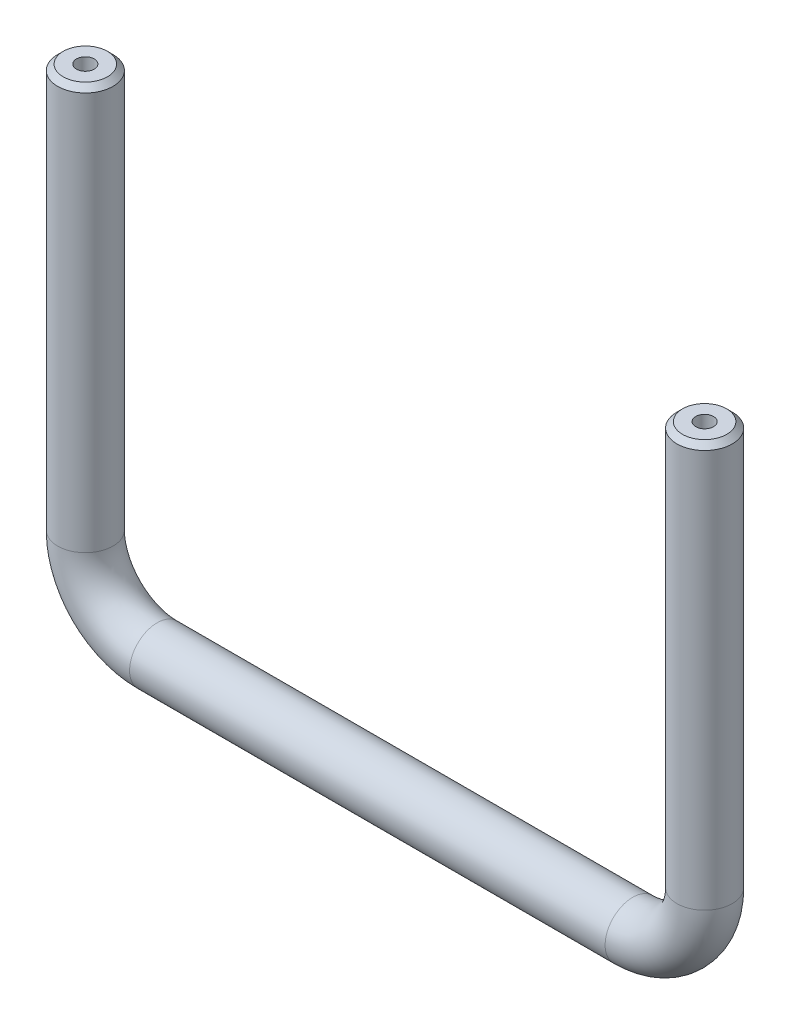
ISO-10303-21;
HEADER;
FILE_DESCRIPTION(('STEP AP214'),'2;1');
FILE_NAME('part.step','',(''),(''),'','','');
FILE_SCHEMA(('AUTOMOTIVE_DESIGN { 1 0 10303 214 1 1 1 1 }'));
ENDSEC;
DATA;
#1=APPLICATION_CONTEXT('core data for automotive mechanical design processes');
#2=APPLICATION_PROTOCOL_DEFINITION('international standard','automotive_design',2000,#1);
#3=PRODUCT_CONTEXT('',#1,'mechanical');
#4=PRODUCT('Part','Part','',(#3));
#5=PRODUCT_RELATED_PRODUCT_CATEGORY('part','',(#4));
#6=PRODUCT_DEFINITION_FORMATION('','',#4);
#7=PRODUCT_DEFINITION_CONTEXT('part definition',#1,'design');
#8=PRODUCT_DEFINITION('design','',#6,#7);
#9=PRODUCT_DEFINITION_SHAPE('','',#8);
#10=(LENGTH_UNIT() NAMED_UNIT(*) SI_UNIT(.MILLI.,.METRE.));
#11=(NAMED_UNIT(*) PLANE_ANGLE_UNIT() SI_UNIT($,.RADIAN.));
#12=(NAMED_UNIT(*) SI_UNIT($,.STERADIAN.) SOLID_ANGLE_UNIT());
#13=UNCERTAINTY_MEASURE_WITH_UNIT(LENGTH_MEASURE(1.E-05),#10,'distance_accuracy_value','');
#14=(GEOMETRIC_REPRESENTATION_CONTEXT(3) GLOBAL_UNCERTAINTY_ASSIGNED_CONTEXT((#13)) GLOBAL_UNIT_ASSIGNED_CONTEXT((#10,
#11,#12)) REPRESENTATION_CONTEXT('',''));
#15=CARTESIAN_POINT('',(0.,0.,0.));
#16=DIRECTION('',(0.,0.,1.));
#17=DIRECTION('',(1.,0.,0.));
#18=AXIS2_PLACEMENT_3D('',#15,#16,#17);
#19=CARTESIAN_POINT('',(88.9,20.6375,0.));
#20=DIRECTION('',(0.,1.,0.));
#21=DIRECTION('',(-1.,0.,0.));
#22=AXIS2_PLACEMENT_3D('',#19,#20,#21);
#23=CYLINDRICAL_SURFACE('',#22,7.93749999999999);
#24=CARTESIAN_POINT('',(88.8999999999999,134.9375,0.));
#25=DIRECTION('',(0.,1.,0.));
#26=DIRECTION('',(0.,0.,1.));
#27=AXIS2_PLACEMENT_3D('',#24,#25,#26);
#28=CIRCLE('',#27,7.93749999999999);
#29=CARTESIAN_POINT('',(88.8999999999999,134.9375,7.93749999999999));
#30=VERTEX_POINT('',#29);
#31=EDGE_CURVE('E108',#30,#30,#28,.F.);
#32=ORIENTED_EDGE('',*,*,#31,.T.);
#33=EDGE_LOOP('',(#32));
#34=FACE_BOUND('',#33,.T.);
#35=CARTESIAN_POINT('',(88.9,20.6375,0.));
#36=DIRECTION('',(0.,1.,0.));
#37=DIRECTION('',(-1.,0.,0.));
#38=AXIS2_PLACEMENT_3D('',#35,#36,#37);
#39=CIRCLE('',#38,7.93749999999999);
#40=CARTESIAN_POINT('',(96.8375,20.6375,0.));
#41=VERTEX_POINT('',#40);
#42=EDGE_CURVE('E100',#41,#41,#39,.T.);
#43=ORIENTED_EDGE('',*,*,#42,.T.);
#44=EDGE_LOOP('',(#43));
#45=FACE_BOUND('',#44,.T.);
#46=ADVANCED_FACE('F46',(#34,#45),#23,.T.);
#47=CARTESIAN_POINT('',(68.2625,20.6375,0.));
#48=DIRECTION('',(0.,0.,1.));
#49=DIRECTION('',(1.,0.,0.));
#50=AXIS2_PLACEMENT_3D('',#47,#48,#49);
#51=TOROIDAL_SURFACE('',#50,20.6375,7.93749999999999);
#52=CARTESIAN_POINT('',(68.2625,0.,0.));
#53=DIRECTION('',(1.,0.,0.));
#54=DIRECTION('',(0.,1.,0.));
#55=AXIS2_PLACEMENT_3D('',#52,#53,#54);
#56=CIRCLE('',#55,7.93749999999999);
#57=CARTESIAN_POINT('',(68.2625,-7.93749999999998,0.));
#58=VERTEX_POINT('',#57);
#59=EDGE_CURVE('E96',#58,#58,#56,.T.);
#60=CARTESIAN_POINT('',(68.2625,20.6375,0.));
#61=DIRECTION('',(0.,0.,1.));
#62=DIRECTION('',(1.,0.,0.));
#63=AXIS2_PLACEMENT_3D('',#60,#61,#62);
#64=CIRCLE('',#63,28.575);
#65=EDGE_CURVE('',#58,#41,#64,.T.);
#66=ORIENTED_EDGE('',*,*,#59,.T.);
#67=ORIENTED_EDGE('',*,*,#42,.F.);
#68=ORIENTED_EDGE('',*,*,#65,.T.);
#69=ORIENTED_EDGE('',*,*,#65,.F.);
#70=EDGE_LOOP('',(#66,#68,#67,#69));
#71=FACE_BOUND('',#70,.T.);
#72=ADVANCED_FACE('F131',(#71),#51,.T.);
#73=CARTESIAN_POINT('',(-68.2625,0.,0.));
#74=DIRECTION('',(1.,0.,0.));
#75=DIRECTION('',(0.,1.,0.));
#76=AXIS2_PLACEMENT_3D('',#73,#74,#75);
#77=CYLINDRICAL_SURFACE('',#76,7.93749999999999);
#78=CARTESIAN_POINT('',(-68.2625,0.,0.));
#79=DIRECTION('',(1.,0.,0.));
#80=DIRECTION('',(0.,1.,0.));
#81=AXIS2_PLACEMENT_3D('',#78,#79,#80);
#82=CIRCLE('',#81,7.93749999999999);
#83=CARTESIAN_POINT('',(-68.2625,-7.93750000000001,0.));
#84=VERTEX_POINT('',#83);
#85=EDGE_CURVE('E92',#84,#84,#82,.T.);
#86=ORIENTED_EDGE('',*,*,#85,.T.);
#87=EDGE_LOOP('',(#86));
#88=FACE_BOUND('',#87,.T.);
#89=ORIENTED_EDGE('',*,*,#59,.F.);
#90=EDGE_LOOP('',(#89));
#91=FACE_BOUND('',#90,.T.);
#92=ADVANCED_FACE('F137',(#88,#91),#77,.T.);
#93=CARTESIAN_POINT('',(-68.2625,20.6375,0.));
#94=DIRECTION('',(0.,0.,1.));
#95=DIRECTION('',(1.,0.,0.));
#96=AXIS2_PLACEMENT_3D('',#93,#94,#95);
#97=TOROIDAL_SURFACE('',#96,20.6375,7.93749999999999);
#98=CARTESIAN_POINT('',(-88.9,20.6375,0.));
#99=DIRECTION('',(0.,-1.,0.));
#100=DIRECTION('',(1.,0.,0.));
#101=AXIS2_PLACEMENT_3D('',#98,#99,#100);
#102=CIRCLE('',#101,7.93749999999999);
#103=CARTESIAN_POINT('',(-96.8375,20.6375,0.));
#104=VERTEX_POINT('',#103);
#105=EDGE_CURVE('E88',#104,#104,#102,.T.);
#106=CARTESIAN_POINT('',(-68.2625,20.6375,0.));
#107=DIRECTION('',(0.,0.,1.));
#108=DIRECTION('',(1.,0.,0.));
#109=AXIS2_PLACEMENT_3D('',#106,#107,#108);
#110=CIRCLE('',#109,28.575);
#111=EDGE_CURVE('',#104,#84,#110,.T.);
#112=ORIENTED_EDGE('',*,*,#105,.T.);
#113=ORIENTED_EDGE('',*,*,#85,.F.);
#114=ORIENTED_EDGE('',*,*,#111,.T.);
#115=ORIENTED_EDGE('',*,*,#111,.F.);
#116=EDGE_LOOP('',(#112,#114,#113,#115));
#117=FACE_BOUND('',#116,.T.);
#118=ADVANCED_FACE('F144',(#117),#97,.T.);
#119=CARTESIAN_POINT('',(-88.9,20.6375,0.));
#120=DIRECTION('',(0.,1.,0.));
#121=DIRECTION('',(0.,0.,1.));
#122=AXIS2_PLACEMENT_3D('',#119,#120,#121);
#123=CYLINDRICAL_SURFACE('',#122,7.93749999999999);
#124=CARTESIAN_POINT('',(-88.9,134.9375,0.));
#125=DIRECTION('',(0.,-1.,0.));
#126=DIRECTION('',(0.,0.,-1.));
#127=AXIS2_PLACEMENT_3D('',#124,#125,#126);
#128=CIRCLE('',#127,7.93749999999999);
#129=CARTESIAN_POINT('',(-88.9,134.9375,-7.93749999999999));
#130=VERTEX_POINT('',#129);
#131=EDGE_CURVE('E55',#130,#130,#128,.T.);
#132=ORIENTED_EDGE('',*,*,#131,.T.);
#133=EDGE_LOOP('',(#132));
#134=FACE_BOUND('',#133,.T.);
#135=ORIENTED_EDGE('',*,*,#105,.F.);
#136=EDGE_LOOP('',(#135));
#137=FACE_BOUND('',#136,.T.);
#138=ADVANCED_FACE('F115',(#134,#137),#123,.T.);
#139=CARTESIAN_POINT('',(88.8999999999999,136.525,0.));
#140=DIRECTION('',(0.,1.,0.));
#141=DIRECTION('',(-1.,0.,0.));
#142=AXIS2_PLACEMENT_3D('',#139,#140,#141);
#143=PLANE('',#142);
#144=CARTESIAN_POINT('',(88.8999999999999,136.525,0.));
#145=DIRECTION('',(0.,1.,0.));
#146=DIRECTION('',(0.,0.,1.));
#147=AXIS2_PLACEMENT_3D('',#144,#145,#146);
#148=CIRCLE('',#147,2.55269999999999);
#149=CARTESIAN_POINT('',(88.8999999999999,136.525,2.55269999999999));
#150=VERTEX_POINT('',#149);
#151=EDGE_CURVE('E74',#150,#150,#148,.T.);
#152=ORIENTED_EDGE('',*,*,#151,.F.);
#153=EDGE_LOOP('',(#152));
#154=FACE_BOUND('',#153,.T.);
#155=CARTESIAN_POINT('',(88.8999999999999,136.525,0.));
#156=DIRECTION('',(0.,1.,0.));
#157=DIRECTION('',(-1.,0.,0.));
#158=AXIS2_PLACEMENT_3D('',#155,#156,#157);
#159=CIRCLE('',#158,6.34999999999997);
#160=CARTESIAN_POINT('',(82.55,136.525,0.));
#161=VERTEX_POINT('',#160);
#162=EDGE_CURVE('E104',#161,#161,#159,.T.);
#163=ORIENTED_EDGE('',*,*,#162,.T.);
#164=EDGE_LOOP('',(#163));
#165=FACE_BOUND('',#164,.T.);
#166=ADVANCED_FACE('F151',(#154,#165),#143,.T.);
#167=CARTESIAN_POINT('',(-88.9,136.525,0.));
#168=DIRECTION('',(0.,-1.,0.));
#169=DIRECTION('',(1.,0.,0.));
#170=AXIS2_PLACEMENT_3D('',#167,#168,#169);
#171=PLANE('',#170);
#172=CARTESIAN_POINT('',(-88.9,136.525,0.));
#173=DIRECTION('',(0.,1.,0.));
#174=DIRECTION('',(0.,0.,1.));
#175=AXIS2_PLACEMENT_3D('',#172,#173,#174);
#176=CIRCLE('',#175,2.55269999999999);
#177=CARTESIAN_POINT('',(-88.9,136.525,2.55269999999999));
#178=VERTEX_POINT('',#177);
#179=EDGE_CURVE('E75',#178,#178,#176,.T.);
#180=ORIENTED_EDGE('',*,*,#179,.F.);
#181=EDGE_LOOP('',(#180));
#182=FACE_BOUND('',#181,.T.);
#183=CARTESIAN_POINT('',(-88.9,136.525,0.));
#184=DIRECTION('',(0.,-1.,0.));
#185=DIRECTION('',(1.,0.,0.));
#186=AXIS2_PLACEMENT_3D('',#183,#184,#185);
#187=CIRCLE('',#186,6.35000000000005);
#188=CARTESIAN_POINT('',(-82.55,136.525,0.));
#189=VERTEX_POINT('',#188);
#190=EDGE_CURVE('E11',#189,#189,#187,.F.);
#191=ORIENTED_EDGE('',*,*,#190,.T.);
#192=EDGE_LOOP('',(#191));
#193=FACE_BOUND('',#192,.T.);
#194=ADVANCED_FACE('F127',(#182,#193),#171,.F.);
#195=CARTESIAN_POINT('',(88.8999999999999,136.525,0.));
#196=DIRECTION('',(0.,-1.,0.));
#197=DIRECTION('',(0.,0.,-1.));
#198=AXIS2_PLACEMENT_3D('',#195,#196,#197);
#199=CONICAL_SURFACE('',#198,6.34999999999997,0.78539816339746);
#200=ORIENTED_EDGE('',*,*,#31,.F.);
#201=EDGE_LOOP('',(#200));
#202=FACE_BOUND('',#201,.T.);
#203=ORIENTED_EDGE('',*,*,#162,.F.);
#204=EDGE_LOOP('',(#203));
#205=FACE_BOUND('',#204,.T.);
#206=ADVANCED_FACE('F120',(#202,#205),#199,.T.);
#207=CARTESIAN_POINT('',(-88.9,134.9375,0.));
#208=DIRECTION('',(0.,-1.,0.));
#209=DIRECTION('',(0.,0.,-1.));
#210=AXIS2_PLACEMENT_3D('',#207,#208,#209);
#211=CONICAL_SURFACE('',#210,7.93749999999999,0.785398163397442);
#212=ORIENTED_EDGE('',*,*,#190,.F.);
#213=EDGE_LOOP('',(#212));
#214=FACE_BOUND('',#213,.T.);
#215=ORIENTED_EDGE('',*,*,#131,.F.);
#216=EDGE_LOOP('',(#215));
#217=FACE_BOUND('',#216,.T.);
#218=ADVANCED_FACE('F48',(#214,#217),#211,.T.);
#219=CARTESIAN_POINT('',(88.8999999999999,111.125,0.));
#220=DIRECTION('',(0.,1.,0.));
#221=DIRECTION('',(0.,0.,1.));
#222=AXIS2_PLACEMENT_3D('',#219,#220,#221);
#223=CONICAL_SURFACE('',#222,2.55269999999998,1.02974425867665);
#224=CARTESIAN_POINT('',(88.8999999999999,109.591183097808,0.));
#225=VERTEX_POINT('',#224);
#226=VERTEX_LOOP('',#225);
#227=FACE_BOUND('',#226,.T.);
#228=CARTESIAN_POINT('',(88.8999999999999,111.125,0.));
#229=DIRECTION('',(0.,1.,0.));
#230=DIRECTION('',(0.,0.,1.));
#231=AXIS2_PLACEMENT_3D('',#228,#229,#230);
#232=CIRCLE('',#231,2.55269999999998);
#233=CARTESIAN_POINT('',(88.8999999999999,111.125,2.55269999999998));
#234=VERTEX_POINT('',#233);
#235=EDGE_CURVE('E80',#234,#234,#232,.T.);
#236=ORIENTED_EDGE('',*,*,#235,.T.);
#237=EDGE_LOOP('',(#236));
#238=FACE_BOUND('',#237,.T.);
#239=ADVANCED_FACE('F119',(#227,#238),#223,.F.);
#240=CARTESIAN_POINT('',(88.8999999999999,136.525,0.));
#241=DIRECTION('',(0.,1.,0.));
#242=DIRECTION('',(0.,0.,1.));
#243=AXIS2_PLACEMENT_3D('',#240,#241,#242);
#244=CYLINDRICAL_SURFACE('',#243,2.55269999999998);
#245=ORIENTED_EDGE('',*,*,#235,.F.);
#246=EDGE_LOOP('',(#245));
#247=FACE_BOUND('',#246,.T.);
#248=ORIENTED_EDGE('',*,*,#151,.T.);
#249=EDGE_LOOP('',(#248));
#250=FACE_BOUND('',#249,.T.);
#251=ADVANCED_FACE('F67',(#247,#250),#244,.F.);
#252=CARTESIAN_POINT('',(-88.9,111.125,0.));
#253=DIRECTION('',(0.,1.,0.));
#254=DIRECTION('',(0.,0.,1.));
#255=AXIS2_PLACEMENT_3D('',#252,#253,#254);
#256=CONICAL_SURFACE('',#255,2.55269999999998,1.02974425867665);
#257=CARTESIAN_POINT('',(-88.9,109.591183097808,0.));
#258=VERTEX_POINT('',#257);
#259=VERTEX_LOOP('',#258);
#260=FACE_BOUND('',#259,.T.);
#261=CARTESIAN_POINT('',(-88.9,111.125,0.));
#262=DIRECTION('',(0.,1.,0.));
#263=DIRECTION('',(0.,0.,1.));
#264=AXIS2_PLACEMENT_3D('',#261,#262,#263);
#265=CIRCLE('',#264,2.55269999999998);
#266=CARTESIAN_POINT('',(-88.9,111.125,2.55269999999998));
#267=VERTEX_POINT('',#266);
#268=EDGE_CURVE('E71',#267,#267,#265,.T.);
#269=ORIENTED_EDGE('',*,*,#268,.T.);
#270=EDGE_LOOP('',(#269));
#271=FACE_BOUND('',#270,.T.);
#272=ADVANCED_FACE('F63',(#260,#271),#256,.F.);
#273=CARTESIAN_POINT('',(-88.9,136.525,0.));
#274=DIRECTION('',(0.,1.,0.));
#275=DIRECTION('',(0.,0.,1.));
#276=AXIS2_PLACEMENT_3D('',#273,#274,#275);
#277=CYLINDRICAL_SURFACE('',#276,2.55269999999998);
#278=ORIENTED_EDGE('',*,*,#268,.F.);
#279=EDGE_LOOP('',(#278));
#280=FACE_BOUND('',#279,.T.);
#281=ORIENTED_EDGE('',*,*,#179,.T.);
#282=EDGE_LOOP('',(#281));
#283=FACE_BOUND('',#282,.T.);
#284=ADVANCED_FACE('F66',(#280,#283),#277,.F.);
#285=CLOSED_SHELL('',(#46,#72,#92,#118,#138,#166,#194,#206,#218,#239,#251,#272,#284));
#286=MANIFOLD_SOLID_BREP('B2',#285);
#287=ADVANCED_BREP_SHAPE_REPRESENTATION('',(#18,#286),#14);
#288=SHAPE_DEFINITION_REPRESENTATION(#9,#287);
ENDSEC;
END-ISO-10303-21;
